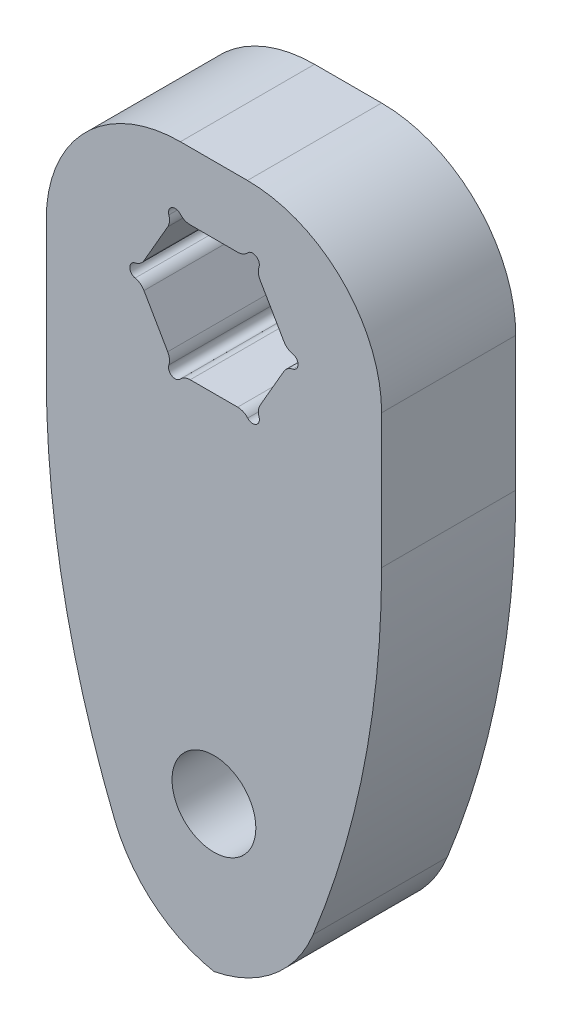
ISO-10303-21;
HEADER;
FILE_DESCRIPTION(('STEP AP214'),'2;1');
FILE_NAME('part.step','',(''),(''),'','','');
FILE_SCHEMA(('AUTOMOTIVE_DESIGN { 1 0 10303 214 1 1 1 1 }'));
ENDSEC;
DATA;
#1=APPLICATION_CONTEXT('core data for automotive mechanical design processes');
#2=APPLICATION_PROTOCOL_DEFINITION('international standard','automotive_design',2000,#1);
#3=PRODUCT_CONTEXT('',#1,'mechanical');
#4=PRODUCT('Part','Part','',(#3));
#5=PRODUCT_RELATED_PRODUCT_CATEGORY('part','',(#4));
#6=PRODUCT_DEFINITION_FORMATION('','',#4);
#7=PRODUCT_DEFINITION_CONTEXT('part definition',#1,'design');
#8=PRODUCT_DEFINITION('design','',#6,#7);
#9=PRODUCT_DEFINITION_SHAPE('','',#8);
#10=(LENGTH_UNIT() NAMED_UNIT(*) SI_UNIT(.MILLI.,.METRE.));
#11=(NAMED_UNIT(*) PLANE_ANGLE_UNIT() SI_UNIT($,.RADIAN.));
#12=(NAMED_UNIT(*) SI_UNIT($,.STERADIAN.) SOLID_ANGLE_UNIT());
#13=UNCERTAINTY_MEASURE_WITH_UNIT(LENGTH_MEASURE(1.E-05),#10,'distance_accuracy_value','');
#14=(GEOMETRIC_REPRESENTATION_CONTEXT(3) GLOBAL_UNCERTAINTY_ASSIGNED_CONTEXT((#13)) GLOBAL_UNIT_ASSIGNED_CONTEXT((#10,
#11,#12)) REPRESENTATION_CONTEXT('',''));
#15=CARTESIAN_POINT('',(0.,0.,0.));
#16=DIRECTION('',(0.,0.,1.));
#17=DIRECTION('',(1.,0.,0.));
#18=AXIS2_PLACEMENT_3D('',#15,#16,#17);
#19=CARTESIAN_POINT('',(0.,0.,12.7));
#20=DIRECTION('',(0.,0.,-1.));
#21=DIRECTION('',(-1.,0.,0.));
#22=AXIS2_PLACEMENT_3D('',#19,#20,#21);
#23=PLANE('',#22);
#24=CARTESIAN_POINT('',(-3.66617420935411,6.35000000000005,12.7));
#25=DIRECTION('',(0.,0.,1.));
#26=DIRECTION('',(1.,0.,0.));
#27=AXIS2_PLACEMENT_3D('',#24,#25,#26);
#28=CIRCLE('',#27,0.635);
#29=CARTESIAN_POINT('',(-3.19287315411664,6.77333333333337,12.7));
#30=VERTEX_POINT('',#29);
#31=CARTESIAN_POINT('',(-4.26944215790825,6.15177592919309,12.7));
#32=VERTEX_POINT('',#31);
#33=EDGE_CURVE('E314',#30,#32,#28,.T.);
#34=ORIENTED_EDGE('',*,*,#33,.F.);
#35=CARTESIAN_POINT('',(-2.2462710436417,7.62000000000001,12.7));
#36=DIRECTION('',(0.,0.,-1.));
#37=DIRECTION('',(-1.,0.,0.));
#38=AXIS2_PLACEMENT_3D('',#35,#36,#37);
#39=CIRCLE('',#38,1.27);
#40=CARTESIAN_POINT('',(-2.2462710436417,6.35,12.7));
#41=VERTEX_POINT('',#40);
#42=EDGE_CURVE('E404',#30,#41,#39,.F.);
#43=ORIENTED_EDGE('',*,*,#42,.T.);
#44=DIRECTION('',(-1.,0.,0.));
#45=VECTOR('',#44,1.);
#46=CARTESIAN_POINT('',(3.66617420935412,6.35000000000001,12.7));
#47=LINE('',#46,#45);
#48=CARTESIAN_POINT('',(2.24627104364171,6.35000000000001,12.7));
#49=VERTEX_POINT('',#48);
#50=EDGE_CURVE('E336',#49,#41,#47,.T.);
#51=ORIENTED_EDGE('',*,*,#50,.F.);
#52=CARTESIAN_POINT('',(2.24627104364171,7.62000000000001,12.7));
#53=DIRECTION('',(0.,0.,-1.));
#54=DIRECTION('',(-1.,0.,0.));
#55=AXIS2_PLACEMENT_3D('',#52,#53,#54);
#56=CIRCLE('',#55,1.27);
#57=CARTESIAN_POINT('',(3.19287315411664,6.77333333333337,12.7));
#58=VERTEX_POINT('',#57);
#59=EDGE_CURVE('E402',#49,#58,#56,.F.);
#60=ORIENTED_EDGE('',*,*,#59,.T.);
#61=CARTESIAN_POINT('',(3.66617420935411,6.35000000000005,12.7));
#62=DIRECTION('',(0.,0.,1.));
#63=DIRECTION('',(1.,0.,0.));
#64=AXIS2_PLACEMENT_3D('',#61,#62,#63);
#65=CIRCLE('',#64,0.635000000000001);
#66=CARTESIAN_POINT('',(4.26944215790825,6.15177592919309,12.7));
#67=VERTEX_POINT('',#66);
#68=EDGE_CURVE('E308',#67,#58,#65,.T.);
#69=ORIENTED_EDGE('',*,*,#68,.F.);
#70=CARTESIAN_POINT('',(5.47597805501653,5.75532778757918,12.7));
#71=DIRECTION('',(0.,0.,-1.));
#72=DIRECTION('',(-1.,0.,0.));
#73=AXIS2_PLACEMENT_3D('',#70,#71,#72);
#74=CIRCLE('',#73,1.27);
#75=CARTESIAN_POINT('',(4.37612579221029,5.12032778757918,12.7));
#76=VERTEX_POINT('',#75);
#77=EDGE_CURVE('E400',#67,#76,#74,.F.);
#78=ORIENTED_EDGE('',*,*,#77,.T.);
#79=DIRECTION('',(-0.5,0.866025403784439,0.));
#80=VECTOR('',#79,1.);
#81=CARTESIAN_POINT('',(7.33234841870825,0.,12.7));
#82=LINE('',#81,#80);
#83=CARTESIAN_POINT('',(6.62239683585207,1.22967221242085,12.7));
#84=VERTEX_POINT('',#83);
#85=EDGE_CURVE('E332',#84,#76,#82,.T.);
#86=ORIENTED_EDGE('',*,*,#85,.F.);
#87=CARTESIAN_POINT('',(7.72224909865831,1.86467221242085,12.7));
#88=DIRECTION('',(0.,0.,-1.));
#89=DIRECTION('',(-1.,0.,0.));
#90=AXIS2_PLACEMENT_3D('',#87,#88,#89);
#91=CIRCLE('',#90,1.27);
#92=CARTESIAN_POINT('',(7.46231531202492,0.621557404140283,12.7));
#93=VERTEX_POINT('',#92);
#94=EDGE_CURVE('E398',#84,#93,#91,.F.);
#95=ORIENTED_EDGE('',*,*,#94,.T.);
#96=CARTESIAN_POINT('',(7.33234841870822,0.,12.7));
#97=DIRECTION('',(0.,0.,1.));
#98=DIRECTION('',(1.,0.,0.));
#99=AXIS2_PLACEMENT_3D('',#96,#97,#98);
#100=CIRCLE('',#99,0.635000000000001);
#101=CARTESIAN_POINT('',(7.46231531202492,-0.621557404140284,12.7));
#102=VERTEX_POINT('',#101);
#103=EDGE_CURVE('E302',#102,#93,#100,.T.);
#104=ORIENTED_EDGE('',*,*,#103,.F.);
#105=CARTESIAN_POINT('',(7.7222490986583,-1.86467221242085,12.7));
#106=DIRECTION('',(0.,0.,-1.));
#107=DIRECTION('',(-1.,0.,0.));
#108=AXIS2_PLACEMENT_3D('',#105,#106,#107);
#109=CIRCLE('',#108,1.27);
#110=CARTESIAN_POINT('',(6.62239683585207,-1.22967221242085,12.7));
#111=VERTEX_POINT('',#110);
#112=EDGE_CURVE('E396',#102,#111,#109,.F.);
#113=ORIENTED_EDGE('',*,*,#112,.T.);
#114=DIRECTION('',(0.5,0.866025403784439,0.));
#115=VECTOR('',#114,1.);
#116=CARTESIAN_POINT('',(3.66617420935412,-6.35,12.7));
#117=LINE('',#116,#115);
#118=CARTESIAN_POINT('',(4.3761257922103,-5.12032778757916,12.7));
#119=VERTEX_POINT('',#118);
#120=EDGE_CURVE('E329',#119,#111,#117,.T.);
#121=ORIENTED_EDGE('',*,*,#120,.F.);
#122=CARTESIAN_POINT('',(5.47597805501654,-5.75532778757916,12.7));
#123=DIRECTION('',(0.,0.,-1.));
#124=DIRECTION('',(-1.,0.,0.));
#125=AXIS2_PLACEMENT_3D('',#122,#123,#124);
#126=CIRCLE('',#125,1.27);
#127=CARTESIAN_POINT('',(4.26944215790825,-6.15177592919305,12.7));
#128=VERTEX_POINT('',#127);
#129=EDGE_CURVE('E394',#119,#128,#126,.F.);
#130=ORIENTED_EDGE('',*,*,#129,.T.);
#131=CARTESIAN_POINT('',(3.66617420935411,-6.34999999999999,12.7));
#132=DIRECTION('',(0.,0.,1.));
#133=DIRECTION('',(1.,0.,0.));
#134=AXIS2_PLACEMENT_3D('',#131,#132,#133);
#135=CIRCLE('',#134,0.635000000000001);
#136=CARTESIAN_POINT('',(3.19287315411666,-6.77333333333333,12.7));
#137=VERTEX_POINT('',#136);
#138=EDGE_CURVE('E296',#137,#128,#135,.T.);
#139=ORIENTED_EDGE('',*,*,#138,.F.);
#140=CARTESIAN_POINT('',(2.24627104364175,-7.62,12.7));
#141=DIRECTION('',(0.,0.,-1.));
#142=DIRECTION('',(-1.,0.,0.));
#143=AXIS2_PLACEMENT_3D('',#140,#141,#142);
#144=CIRCLE('',#143,1.27);
#145=CARTESIAN_POINT('',(2.24627104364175,-6.35,12.7));
#146=VERTEX_POINT('',#145);
#147=EDGE_CURVE('E392',#137,#146,#144,.F.);
#148=ORIENTED_EDGE('',*,*,#147,.T.);
#149=DIRECTION('',(1.,0.,0.));
#150=VECTOR('',#149,1.);
#151=CARTESIAN_POINT('',(-3.66617420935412,-6.35,12.7));
#152=LINE('',#151,#150);
#153=CARTESIAN_POINT('',(-2.24627104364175,-6.35,12.7));
#154=VERTEX_POINT('',#153);
#155=EDGE_CURVE('E345',#154,#146,#152,.T.);
#156=ORIENTED_EDGE('',*,*,#155,.F.);
#157=CARTESIAN_POINT('',(-2.24627104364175,-7.62,12.7));
#158=DIRECTION('',(0.,0.,-1.));
#159=DIRECTION('',(-1.,0.,0.));
#160=AXIS2_PLACEMENT_3D('',#157,#158,#159);
#161=CIRCLE('',#160,1.27);
#162=CARTESIAN_POINT('',(-3.19287315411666,-6.77333333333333,12.7));
#163=VERTEX_POINT('',#162);
#164=EDGE_CURVE('E390',#154,#163,#161,.F.);
#165=ORIENTED_EDGE('',*,*,#164,.T.);
#166=CARTESIAN_POINT('',(-3.66617420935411,-6.34999999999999,12.7));
#167=DIRECTION('',(0.,0.,1.));
#168=DIRECTION('',(1.,0.,0.));
#169=AXIS2_PLACEMENT_3D('',#166,#167,#168);
#170=CIRCLE('',#169,0.635);
#171=CARTESIAN_POINT('',(-4.26944215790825,-6.15177592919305,12.7));
#172=VERTEX_POINT('',#171);
#173=EDGE_CURVE('E290',#172,#163,#170,.T.);
#174=ORIENTED_EDGE('',*,*,#173,.F.);
#175=CARTESIAN_POINT('',(-5.47597805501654,-5.75532778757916,12.7));
#176=DIRECTION('',(0.,0.,-1.));
#177=DIRECTION('',(-1.,0.,0.));
#178=AXIS2_PLACEMENT_3D('',#175,#176,#177);
#179=CIRCLE('',#178,1.27);
#180=CARTESIAN_POINT('',(-4.3761257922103,-5.12032778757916,12.7));
#181=VERTEX_POINT('',#180);
#182=EDGE_CURVE('E388',#172,#181,#179,.F.);
#183=ORIENTED_EDGE('',*,*,#182,.T.);
#184=DIRECTION('',(0.5,-0.866025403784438,0.));
#185=VECTOR('',#184,1.);
#186=CARTESIAN_POINT('',(-7.33234841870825,0.,12.7));
#187=LINE('',#186,#185);
#188=CARTESIAN_POINT('',(-6.62239683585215,-1.22967221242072,12.7));
#189=VERTEX_POINT('',#188);
#190=EDGE_CURVE('E342',#189,#181,#187,.T.);
#191=ORIENTED_EDGE('',*,*,#190,.F.);
#192=CARTESIAN_POINT('',(-7.72224909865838,-1.86467221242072,12.7));
#193=DIRECTION('',(0.,0.,-1.));
#194=DIRECTION('',(-1.,0.,0.));
#195=AXIS2_PLACEMENT_3D('',#192,#193,#194);
#196=CIRCLE('',#195,1.27);
#197=CARTESIAN_POINT('',(-7.46231531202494,-0.621557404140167,12.7));
#198=VERTEX_POINT('',#197);
#199=EDGE_CURVE('E386',#189,#198,#196,.F.);
#200=ORIENTED_EDGE('',*,*,#199,.T.);
#201=CARTESIAN_POINT('',(-7.33234841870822,1.11022302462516E-13,12.7));
#202=DIRECTION('',(0.,0.,1.));
#203=DIRECTION('',(1.,0.,0.));
#204=AXIS2_PLACEMENT_3D('',#201,#202,#203);
#205=CIRCLE('',#204,0.635000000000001);
#206=CARTESIAN_POINT('',(-7.46231531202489,0.621557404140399,12.7));
#207=VERTEX_POINT('',#206);
#208=EDGE_CURVE('E286',#207,#198,#205,.T.);
#209=ORIENTED_EDGE('',*,*,#208,.F.);
#210=CARTESIAN_POINT('',(-7.72224909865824,1.86467221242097,12.7));
#211=DIRECTION('',(0.,0.,-1.));
#212=DIRECTION('',(-1.,0.,0.));
#213=AXIS2_PLACEMENT_3D('',#210,#211,#212);
#214=CIRCLE('',#213,1.27);
#215=CARTESIAN_POINT('',(-6.622396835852,1.22967221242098,12.7));
#216=VERTEX_POINT('',#215);
#217=EDGE_CURVE('E384',#207,#216,#214,.F.);
#218=ORIENTED_EDGE('',*,*,#217,.T.);
#219=DIRECTION('',(-0.5,-0.866025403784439,0.));
#220=VECTOR('',#219,1.);
#221=CARTESIAN_POINT('',(-3.66617420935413,6.35,12.7));
#222=LINE('',#221,#220);
#223=CARTESIAN_POINT('',(-4.37612579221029,5.12032778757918,12.7));
#224=VERTEX_POINT('',#223);
#225=EDGE_CURVE('E339',#224,#216,#222,.T.);
#226=ORIENTED_EDGE('',*,*,#225,.F.);
#227=CARTESIAN_POINT('',(-5.47597805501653,5.75532778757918,12.7));
#228=DIRECTION('',(0.,0.,-1.));
#229=DIRECTION('',(-1.,0.,0.));
#230=AXIS2_PLACEMENT_3D('',#227,#228,#229);
#231=CIRCLE('',#230,1.27);
#232=EDGE_CURVE('E382',#224,#32,#231,.F.);
#233=ORIENTED_EDGE('',*,*,#232,.T.);
#234=EDGE_LOOP('',(#34,#43,#51,#60,#69,#78,#86,#95,#104,#113,#121,#130,#139,#148,#156,#165,#174,
#183,#191,#200,#209,#218,#226,#233));
#235=FACE_BOUND('',#234,.T.);
#236=CARTESIAN_POINT('',(0.,-40.000682,12.7));
#237=DIRECTION('',(0.,0.,1.));
#238=DIRECTION('',(1.,0.,0.));
#239=AXIS2_PLACEMENT_3D('',#236,#237,#238);
#240=CIRCLE('',#239,3.96875);
#241=CARTESIAN_POINT('',(3.96875,-40.000682,12.7));
#242=VERTEX_POINT('',#241);
#243=EDGE_CURVE('E320',#242,#242,#240,.T.);
#244=ORIENTED_EDGE('',*,*,#243,.F.);
#245=EDGE_LOOP('',(#244));
#246=FACE_BOUND('',#245,.T.);
#247=CARTESIAN_POINT('',(73.025,-12.7,12.7));
#248=DIRECTION('',(0.,0.,1.));
#249=DIRECTION('',(1.,0.,0.));
#250=AXIS2_PLACEMENT_3D('',#247,#248,#249);
#251=CIRCLE('',#250,88.9);
#252=CARTESIAN_POINT('',(-15.875,-12.7,12.7));
#253=VERTEX_POINT('',#252);
#254=CARTESIAN_POINT('',(-9.38750568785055,-46.0375,12.7));
#255=VERTEX_POINT('',#254);
#256=EDGE_CURVE('E272',#253,#255,#251,.T.);
#257=ORIENTED_EDGE('',*,*,#256,.T.);
#258=CARTESIAN_POINT('',(2.38570941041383,-41.275,12.7));
#259=DIRECTION('',(0.,0.,-1.));
#260=DIRECTION('',(-1.,0.,0.));
#261=AXIS2_PLACEMENT_3D('',#258,#259,#260);
#262=CIRCLE('',#261,12.7);
#263=CARTESIAN_POINT('',(0.,-53.7489083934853,12.7));
#264=VERTEX_POINT('',#263);
#265=EDGE_CURVE('E492',#255,#264,#262,.F.);
#266=ORIENTED_EDGE('',*,*,#265,.T.);
#267=CARTESIAN_POINT('',(-2.38570941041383,-41.275,12.7));
#268=DIRECTION('',(0.,0.,-1.));
#269=DIRECTION('',(-1.,0.,0.));
#270=AXIS2_PLACEMENT_3D('',#267,#268,#269);
#271=CIRCLE('',#270,12.7);
#272=CARTESIAN_POINT('',(9.38750568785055,-46.0375,12.7));
#273=VERTEX_POINT('',#272);
#274=EDGE_CURVE('E490',#264,#273,#271,.F.);
#275=ORIENTED_EDGE('',*,*,#274,.T.);
#276=CARTESIAN_POINT('',(-73.025,-12.7,12.7));
#277=DIRECTION('',(0.,0.,1.));
#278=DIRECTION('',(1.,0.,0.));
#279=AXIS2_PLACEMENT_3D('',#276,#277,#278);
#280=CIRCLE('',#279,88.9);
#281=CARTESIAN_POINT('',(15.875,-12.7,12.7));
#282=VERTEX_POINT('',#281);
#283=EDGE_CURVE('E273',#282,#273,#280,.F.);
#284=ORIENTED_EDGE('',*,*,#283,.F.);
#285=DIRECTION('',(0.,1.,0.));
#286=VECTOR('',#285,1.);
#287=CARTESIAN_POINT('',(15.875,12.7,12.7));
#288=LINE('',#287,#286);
#289=CARTESIAN_POINT('',(15.875,0.,12.7));
#290=VERTEX_POINT('',#289);
#291=EDGE_CURVE('E261',#282,#290,#288,.T.);
#292=ORIENTED_EDGE('',*,*,#291,.T.);
#293=CARTESIAN_POINT('',(3.175,0.,12.7));
#294=DIRECTION('',(0.,0.,-1.));
#295=DIRECTION('',(-1.,0.,0.));
#296=AXIS2_PLACEMENT_3D('',#293,#294,#295);
#297=CIRCLE('',#296,12.7);
#298=CARTESIAN_POINT('',(3.175,12.7,12.7));
#299=VERTEX_POINT('',#298);
#300=EDGE_CURVE('E488',#290,#299,#297,.F.);
#301=ORIENTED_EDGE('',*,*,#300,.T.);
#302=DIRECTION('',(-1.,0.,0.));
#303=VECTOR('',#302,1.);
#304=CARTESIAN_POINT('',(-15.875,12.7,12.7));
#305=LINE('',#304,#303);
#306=CARTESIAN_POINT('',(-3.175,12.7,12.7));
#307=VERTEX_POINT('',#306);
#308=EDGE_CURVE('E367',#299,#307,#305,.T.);
#309=ORIENTED_EDGE('',*,*,#308,.T.);
#310=CARTESIAN_POINT('',(-3.175,0.,12.7));
#311=DIRECTION('',(0.,0.,-1.));
#312=DIRECTION('',(-1.,0.,0.));
#313=AXIS2_PLACEMENT_3D('',#310,#311,#312);
#314=CIRCLE('',#313,12.7);
#315=CARTESIAN_POINT('',(-15.875,0.,12.7));
#316=VERTEX_POINT('',#315);
#317=EDGE_CURVE('E486',#307,#316,#314,.F.);
#318=ORIENTED_EDGE('',*,*,#317,.T.);
#319=DIRECTION('',(0.,-1.,0.));
#320=VECTOR('',#319,1.);
#321=CARTESIAN_POINT('',(-15.875,-53.975,12.7));
#322=LINE('',#321,#320);
#323=EDGE_CURVE('E370',#316,#253,#322,.T.);
#324=ORIENTED_EDGE('',*,*,#323,.T.);
#325=EDGE_LOOP('',(#257,#266,#275,#284,#292,#301,#309,#318,#324));
#326=FACE_BOUND('',#325,.T.);
#327=ADVANCED_FACE('F37',(#235,#246,#326),#23,.F.);
#328=CARTESIAN_POINT('',(0.,0.,0.));
#329=DIRECTION('',(0.,0.,-1.));
#330=DIRECTION('',(-1.,0.,0.));
#331=AXIS2_PLACEMENT_3D('',#328,#329,#330);
#332=PLANE('',#331);
#333=CARTESIAN_POINT('',(0.,-40.000682,0.));
#334=DIRECTION('',(0.,0.,1.));
#335=DIRECTION('',(1.,0.,0.));
#336=AXIS2_PLACEMENT_3D('',#333,#334,#335);
#337=CIRCLE('',#336,3.96875);
#338=CARTESIAN_POINT('',(3.96875,-40.000682,0.));
#339=VERTEX_POINT('',#338);
#340=EDGE_CURVE('E325',#339,#339,#337,.T.);
#341=ORIENTED_EDGE('',*,*,#340,.T.);
#342=EDGE_LOOP('',(#341));
#343=FACE_BOUND('',#342,.T.);
#344=DIRECTION('',(-1.,0.,0.));
#345=VECTOR('',#344,1.);
#346=CARTESIAN_POINT('',(3.66617420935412,6.35000000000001,0.));
#347=LINE('',#346,#345);
#348=CARTESIAN_POINT('',(2.24627104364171,6.35000000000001,0.));
#349=VERTEX_POINT('',#348);
#350=CARTESIAN_POINT('',(-2.2462710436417,6.35,0.));
#351=VERTEX_POINT('',#350);
#352=EDGE_CURVE('E354',#349,#351,#347,.T.);
#353=ORIENTED_EDGE('',*,*,#352,.T.);
#354=CARTESIAN_POINT('',(-2.2462710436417,7.62000000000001,0.));
#355=DIRECTION('',(0.,0.,-1.));
#356=DIRECTION('',(-1.,0.,0.));
#357=AXIS2_PLACEMENT_3D('',#354,#355,#356);
#358=CIRCLE('',#357,1.27);
#359=CARTESIAN_POINT('',(-3.19287315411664,6.77333333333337,0.));
#360=VERTEX_POINT('',#359);
#361=EDGE_CURVE('E432',#351,#360,#358,.T.);
#362=ORIENTED_EDGE('',*,*,#361,.T.);
#363=CARTESIAN_POINT('',(-3.66617420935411,6.35000000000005,0.));
#364=DIRECTION('',(0.,0.,1.));
#365=DIRECTION('',(1.,0.,0.));
#366=AXIS2_PLACEMENT_3D('',#363,#364,#365);
#367=CIRCLE('',#366,0.635);
#368=CARTESIAN_POINT('',(-4.26944215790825,6.15177592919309,0.));
#369=VERTEX_POINT('',#368);
#370=EDGE_CURVE('E317',#360,#369,#367,.T.);
#371=ORIENTED_EDGE('',*,*,#370,.T.);
#372=CARTESIAN_POINT('',(-5.47597805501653,5.75532778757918,0.));
#373=DIRECTION('',(0.,0.,-1.));
#374=DIRECTION('',(-1.,0.,0.));
#375=AXIS2_PLACEMENT_3D('',#372,#373,#374);
#376=CIRCLE('',#375,1.27);
#377=CARTESIAN_POINT('',(-4.37612579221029,5.12032778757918,0.));
#378=VERTEX_POINT('',#377);
#379=EDGE_CURVE('E410',#369,#378,#376,.T.);
#380=ORIENTED_EDGE('',*,*,#379,.T.);
#381=DIRECTION('',(-0.5,-0.866025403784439,0.));
#382=VECTOR('',#381,1.);
#383=CARTESIAN_POINT('',(-3.66617420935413,6.35,0.));
#384=LINE('',#383,#382);
#385=CARTESIAN_POINT('',(-6.622396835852,1.22967221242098,0.));
#386=VERTEX_POINT('',#385);
#387=EDGE_CURVE('E357',#378,#386,#384,.T.);
#388=ORIENTED_EDGE('',*,*,#387,.T.);
#389=CARTESIAN_POINT('',(-7.72224909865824,1.86467221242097,0.));
#390=DIRECTION('',(0.,0.,-1.));
#391=DIRECTION('',(-1.,0.,0.));
#392=AXIS2_PLACEMENT_3D('',#389,#390,#391);
#393=CIRCLE('',#392,1.27);
#394=CARTESIAN_POINT('',(-7.46231531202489,0.621557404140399,0.));
#395=VERTEX_POINT('',#394);
#396=EDGE_CURVE('E412',#386,#395,#393,.T.);
#397=ORIENTED_EDGE('',*,*,#396,.T.);
#398=CARTESIAN_POINT('',(-7.33234841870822,1.11022302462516E-13,0.));
#399=DIRECTION('',(0.,0.,1.));
#400=DIRECTION('',(1.,0.,0.));
#401=AXIS2_PLACEMENT_3D('',#398,#399,#400);
#402=CIRCLE('',#401,0.635000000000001);
#403=CARTESIAN_POINT('',(-7.46231531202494,-0.621557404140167,0.));
#404=VERTEX_POINT('',#403);
#405=EDGE_CURVE('E287',#395,#404,#402,.T.);
#406=ORIENTED_EDGE('',*,*,#405,.T.);
#407=CARTESIAN_POINT('',(-7.72224909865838,-1.86467221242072,0.));
#408=DIRECTION('',(0.,0.,-1.));
#409=DIRECTION('',(-1.,0.,0.));
#410=AXIS2_PLACEMENT_3D('',#407,#408,#409);
#411=CIRCLE('',#410,1.27);
#412=CARTESIAN_POINT('',(-6.62239683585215,-1.22967221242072,0.));
#413=VERTEX_POINT('',#412);
#414=EDGE_CURVE('E414',#404,#413,#411,.T.);
#415=ORIENTED_EDGE('',*,*,#414,.T.);
#416=DIRECTION('',(0.5,-0.866025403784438,0.));
#417=VECTOR('',#416,1.);
#418=CARTESIAN_POINT('',(-7.33234841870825,0.,0.));
#419=LINE('',#418,#417);
#420=CARTESIAN_POINT('',(-4.3761257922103,-5.12032778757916,0.));
#421=VERTEX_POINT('',#420);
#422=EDGE_CURVE('E360',#413,#421,#419,.T.);
#423=ORIENTED_EDGE('',*,*,#422,.T.);
#424=CARTESIAN_POINT('',(-5.47597805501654,-5.75532778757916,0.));
#425=DIRECTION('',(0.,0.,-1.));
#426=DIRECTION('',(-1.,0.,0.));
#427=AXIS2_PLACEMENT_3D('',#424,#425,#426);
#428=CIRCLE('',#427,1.27);
#429=CARTESIAN_POINT('',(-4.26944215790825,-6.15177592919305,0.));
#430=VERTEX_POINT('',#429);
#431=EDGE_CURVE('E416',#421,#430,#428,.T.);
#432=ORIENTED_EDGE('',*,*,#431,.T.);
#433=CARTESIAN_POINT('',(-3.66617420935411,-6.34999999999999,0.));
#434=DIRECTION('',(0.,0.,1.));
#435=DIRECTION('',(1.,0.,0.));
#436=AXIS2_PLACEMENT_3D('',#433,#434,#435);
#437=CIRCLE('',#436,0.635);
#438=CARTESIAN_POINT('',(-3.19287315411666,-6.77333333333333,0.));
#439=VERTEX_POINT('',#438);
#440=EDGE_CURVE('E293',#430,#439,#437,.T.);
#441=ORIENTED_EDGE('',*,*,#440,.T.);
#442=CARTESIAN_POINT('',(-2.24627104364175,-7.62,0.));
#443=DIRECTION('',(0.,0.,-1.));
#444=DIRECTION('',(-1.,0.,0.));
#445=AXIS2_PLACEMENT_3D('',#442,#443,#444);
#446=CIRCLE('',#445,1.27);
#447=CARTESIAN_POINT('',(-2.24627104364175,-6.35,0.));
#448=VERTEX_POINT('',#447);
#449=EDGE_CURVE('E418',#439,#448,#446,.T.);
#450=ORIENTED_EDGE('',*,*,#449,.T.);
#451=DIRECTION('',(1.,0.,0.));
#452=VECTOR('',#451,1.);
#453=CARTESIAN_POINT('',(-3.66617420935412,-6.35,0.));
#454=LINE('',#453,#452);
#455=CARTESIAN_POINT('',(2.24627104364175,-6.35,0.));
#456=VERTEX_POINT('',#455);
#457=EDGE_CURVE('E333',#448,#456,#454,.T.);
#458=ORIENTED_EDGE('',*,*,#457,.T.);
#459=CARTESIAN_POINT('',(2.24627104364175,-7.62,0.));
#460=DIRECTION('',(0.,0.,-1.));
#461=DIRECTION('',(-1.,0.,0.));
#462=AXIS2_PLACEMENT_3D('',#459,#460,#461);
#463=CIRCLE('',#462,1.27);
#464=CARTESIAN_POINT('',(3.19287315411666,-6.77333333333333,0.));
#465=VERTEX_POINT('',#464);
#466=EDGE_CURVE('E420',#456,#465,#463,.T.);
#467=ORIENTED_EDGE('',*,*,#466,.T.);
#468=CARTESIAN_POINT('',(3.66617420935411,-6.34999999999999,0.));
#469=DIRECTION('',(0.,0.,1.));
#470=DIRECTION('',(1.,0.,0.));
#471=AXIS2_PLACEMENT_3D('',#468,#469,#470);
#472=CIRCLE('',#471,0.635000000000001);
#473=CARTESIAN_POINT('',(4.26944215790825,-6.15177592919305,0.));
#474=VERTEX_POINT('',#473);
#475=EDGE_CURVE('E299',#465,#474,#472,.T.);
#476=ORIENTED_EDGE('',*,*,#475,.T.);
#477=CARTESIAN_POINT('',(5.47597805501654,-5.75532778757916,0.));
#478=DIRECTION('',(0.,0.,-1.));
#479=DIRECTION('',(-1.,0.,0.));
#480=AXIS2_PLACEMENT_3D('',#477,#478,#479);
#481=CIRCLE('',#480,1.27);
#482=CARTESIAN_POINT('',(4.3761257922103,-5.12032778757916,0.));
#483=VERTEX_POINT('',#482);
#484=EDGE_CURVE('E422',#474,#483,#481,.T.);
#485=ORIENTED_EDGE('',*,*,#484,.T.);
#486=DIRECTION('',(0.5,0.866025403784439,0.));
#487=VECTOR('',#486,1.);
#488=CARTESIAN_POINT('',(3.66617420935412,-6.35,0.));
#489=LINE('',#488,#487);
#490=CARTESIAN_POINT('',(6.62239683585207,-1.22967221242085,0.));
#491=VERTEX_POINT('',#490);
#492=EDGE_CURVE('E328',#483,#491,#489,.T.);
#493=ORIENTED_EDGE('',*,*,#492,.T.);
#494=CARTESIAN_POINT('',(7.7222490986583,-1.86467221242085,0.));
#495=DIRECTION('',(0.,0.,-1.));
#496=DIRECTION('',(-1.,0.,0.));
#497=AXIS2_PLACEMENT_3D('',#494,#495,#496);
#498=CIRCLE('',#497,1.27);
#499=CARTESIAN_POINT('',(7.46231531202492,-0.621557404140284,0.));
#500=VERTEX_POINT('',#499);
#501=EDGE_CURVE('E424',#491,#500,#498,.T.);
#502=ORIENTED_EDGE('',*,*,#501,.T.);
#503=CARTESIAN_POINT('',(7.33234841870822,0.,0.));
#504=DIRECTION('',(0.,0.,1.));
#505=DIRECTION('',(1.,0.,0.));
#506=AXIS2_PLACEMENT_3D('',#503,#504,#505);
#507=CIRCLE('',#506,0.635000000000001);
#508=CARTESIAN_POINT('',(7.46231531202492,0.621557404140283,0.));
#509=VERTEX_POINT('',#508);
#510=EDGE_CURVE('E305',#500,#509,#507,.T.);
#511=ORIENTED_EDGE('',*,*,#510,.T.);
#512=CARTESIAN_POINT('',(7.72224909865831,1.86467221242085,0.));
#513=DIRECTION('',(0.,0.,-1.));
#514=DIRECTION('',(-1.,0.,0.));
#515=AXIS2_PLACEMENT_3D('',#512,#513,#514);
#516=CIRCLE('',#515,1.27);
#517=CARTESIAN_POINT('',(6.62239683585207,1.22967221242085,0.));
#518=VERTEX_POINT('',#517);
#519=EDGE_CURVE('E426',#509,#518,#516,.T.);
#520=ORIENTED_EDGE('',*,*,#519,.T.);
#521=DIRECTION('',(-0.5,0.866025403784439,0.));
#522=VECTOR('',#521,1.);
#523=CARTESIAN_POINT('',(7.33234841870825,0.,0.));
#524=LINE('',#523,#522);
#525=CARTESIAN_POINT('',(4.37612579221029,5.12032778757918,0.));
#526=VERTEX_POINT('',#525);
#527=EDGE_CURVE('E351',#518,#526,#524,.T.);
#528=ORIENTED_EDGE('',*,*,#527,.T.);
#529=CARTESIAN_POINT('',(5.47597805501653,5.75532778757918,0.));
#530=DIRECTION('',(0.,0.,-1.));
#531=DIRECTION('',(-1.,0.,0.));
#532=AXIS2_PLACEMENT_3D('',#529,#530,#531);
#533=CIRCLE('',#532,1.27);
#534=CARTESIAN_POINT('',(4.26944215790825,6.15177592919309,0.));
#535=VERTEX_POINT('',#534);
#536=EDGE_CURVE('E428',#526,#535,#533,.T.);
#537=ORIENTED_EDGE('',*,*,#536,.T.);
#538=CARTESIAN_POINT('',(3.66617420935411,6.35000000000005,0.));
#539=DIRECTION('',(0.,0.,1.));
#540=DIRECTION('',(1.,0.,0.));
#541=AXIS2_PLACEMENT_3D('',#538,#539,#540);
#542=CIRCLE('',#541,0.635000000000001);
#543=CARTESIAN_POINT('',(3.19287315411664,6.77333333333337,0.));
#544=VERTEX_POINT('',#543);
#545=EDGE_CURVE('E311',#535,#544,#542,.T.);
#546=ORIENTED_EDGE('',*,*,#545,.T.);
#547=CARTESIAN_POINT('',(2.24627104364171,7.62000000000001,0.));
#548=DIRECTION('',(0.,0.,-1.));
#549=DIRECTION('',(-1.,0.,0.));
#550=AXIS2_PLACEMENT_3D('',#547,#548,#549);
#551=CIRCLE('',#550,1.27);
#552=EDGE_CURVE('E430',#544,#349,#551,.T.);
#553=ORIENTED_EDGE('',*,*,#552,.T.);
#554=EDGE_LOOP('',(#353,#362,#371,#380,#388,#397,#406,#415,#423,#432,#441,#450,#458,#467,#476,
#485,#493,#502,#511,#520,#528,#537,#546,#553));
#555=FACE_BOUND('',#554,.T.);
#556=CARTESIAN_POINT('',(-2.38570941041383,-41.275,0.));
#557=DIRECTION('',(0.,0.,-1.));
#558=DIRECTION('',(-1.,0.,0.));
#559=AXIS2_PLACEMENT_3D('',#556,#557,#558);
#560=CIRCLE('',#559,12.7);
#561=CARTESIAN_POINT('',(9.38750568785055,-46.0375,0.));
#562=VERTEX_POINT('',#561);
#563=CARTESIAN_POINT('',(0.,-53.7489083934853,0.));
#564=VERTEX_POINT('',#563);
#565=EDGE_CURVE('E53',#562,#564,#560,.T.);
#566=ORIENTED_EDGE('',*,*,#565,.T.);
#567=CARTESIAN_POINT('',(2.38570941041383,-41.275,0.));
#568=DIRECTION('',(0.,0.,-1.));
#569=DIRECTION('',(-1.,0.,0.));
#570=AXIS2_PLACEMENT_3D('',#567,#568,#569);
#571=CIRCLE('',#570,12.7);
#572=CARTESIAN_POINT('',(-9.38750568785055,-46.0375,0.));
#573=VERTEX_POINT('',#572);
#574=EDGE_CURVE('E277',#564,#573,#571,.T.);
#575=ORIENTED_EDGE('',*,*,#574,.T.);
#576=CARTESIAN_POINT('',(73.025,-12.7,0.));
#577=DIRECTION('',(0.,0.,1.));
#578=DIRECTION('',(1.,0.,0.));
#579=AXIS2_PLACEMENT_3D('',#576,#577,#578);
#580=CIRCLE('',#579,88.9);
#581=CARTESIAN_POINT('',(-15.875,-12.7,0.));
#582=VERTEX_POINT('',#581);
#583=EDGE_CURVE('E269',#582,#573,#580,.T.);
#584=ORIENTED_EDGE('',*,*,#583,.F.);
#585=DIRECTION('',(0.,-1.,0.));
#586=VECTOR('',#585,1.);
#587=CARTESIAN_POINT('',(-15.875,-53.975,0.));
#588=LINE('',#587,#586);
#589=CARTESIAN_POINT('',(-15.875,0.,0.));
#590=VERTEX_POINT('',#589);
#591=EDGE_CURVE('E254',#590,#582,#588,.T.);
#592=ORIENTED_EDGE('',*,*,#591,.F.);
#593=CARTESIAN_POINT('',(-3.175,0.,0.));
#594=DIRECTION('',(0.,0.,-1.));
#595=DIRECTION('',(-1.,0.,0.));
#596=AXIS2_PLACEMENT_3D('',#593,#594,#595);
#597=CIRCLE('',#596,12.7);
#598=CARTESIAN_POINT('',(-3.175,12.7,0.));
#599=VERTEX_POINT('',#598);
#600=EDGE_CURVE('E494',#590,#599,#597,.T.);
#601=ORIENTED_EDGE('',*,*,#600,.T.);
#602=DIRECTION('',(-1.,0.,0.));
#603=VECTOR('',#602,1.);
#604=CARTESIAN_POINT('',(-15.875,12.7,0.));
#605=LINE('',#604,#603);
#606=CARTESIAN_POINT('',(3.175,12.7,0.));
#607=VERTEX_POINT('',#606);
#608=EDGE_CURVE('E262',#607,#599,#605,.T.);
#609=ORIENTED_EDGE('',*,*,#608,.F.);
#610=CARTESIAN_POINT('',(3.175,0.,0.));
#611=DIRECTION('',(0.,0.,-1.));
#612=DIRECTION('',(-1.,0.,0.));
#613=AXIS2_PLACEMENT_3D('',#610,#611,#612);
#614=CIRCLE('',#613,12.7);
#615=CARTESIAN_POINT('',(15.875,0.,0.));
#616=VERTEX_POINT('',#615);
#617=EDGE_CURVE('E496',#607,#616,#614,.T.);
#618=ORIENTED_EDGE('',*,*,#617,.T.);
#619=DIRECTION('',(0.,1.,0.));
#620=VECTOR('',#619,1.);
#621=CARTESIAN_POINT('',(15.875,12.7,0.));
#622=LINE('',#621,#620);
#623=CARTESIAN_POINT('',(15.875,-12.7,0.));
#624=VERTEX_POINT('',#623);
#625=EDGE_CURVE('E348',#624,#616,#622,.T.);
#626=ORIENTED_EDGE('',*,*,#625,.F.);
#627=CARTESIAN_POINT('',(-73.025,-12.7,0.));
#628=DIRECTION('',(0.,0.,1.));
#629=DIRECTION('',(1.,0.,0.));
#630=AXIS2_PLACEMENT_3D('',#627,#628,#629);
#631=CIRCLE('',#630,88.9);
#632=EDGE_CURVE('E281',#624,#562,#631,.F.);
#633=ORIENTED_EDGE('',*,*,#632,.T.);
#634=EDGE_LOOP('',(#566,#575,#584,#592,#601,#609,#618,#626,#633));
#635=FACE_BOUND('',#634,.T.);
#636=ADVANCED_FACE('F275',(#343,#555,#635),#332,.T.);
#637=CARTESIAN_POINT('',(15.875,12.7,12.7));
#638=DIRECTION('',(-1.,0.,0.));
#639=DIRECTION('',(0.,-1.,0.));
#640=AXIS2_PLACEMENT_3D('',#637,#638,#639);
#641=PLANE('',#640);
#642=ORIENTED_EDGE('',*,*,#625,.T.);
#643=DIRECTION('',(0.,0.,-1.));
#644=VECTOR('',#643,1.);
#645=CARTESIAN_POINT('',(15.875,0.,12.7));
#646=LINE('',#645,#644);
#647=EDGE_CURVE('E46',#616,#290,#646,.F.);
#648=ORIENTED_EDGE('',*,*,#647,.T.);
#649=ORIENTED_EDGE('',*,*,#291,.F.);
#650=DIRECTION('',(0.,0.,1.));
#651=VECTOR('',#650,1.);
#652=CARTESIAN_POINT('',(15.875,-12.7,0.));
#653=LINE('',#652,#651);
#654=EDGE_CURVE('E283',#624,#282,#653,.T.);
#655=ORIENTED_EDGE('',*,*,#654,.F.);
#656=EDGE_LOOP('',(#642,#648,#649,#655));
#657=FACE_BOUND('',#656,.T.);
#658=ADVANCED_FACE('F509',(#657),#641,.F.);
#659=CARTESIAN_POINT('',(-15.875,12.7,12.7));
#660=DIRECTION('',(0.,-1.,0.));
#661=DIRECTION('',(1.,0.,0.));
#662=AXIS2_PLACEMENT_3D('',#659,#660,#661);
#663=PLANE('',#662);
#664=ORIENTED_EDGE('',*,*,#308,.F.);
#665=DIRECTION('',(0.,0.,-1.));
#666=VECTOR('',#665,1.);
#667=CARTESIAN_POINT('',(3.175,12.7,12.7));
#668=LINE('',#667,#666);
#669=EDGE_CURVE('E503',#299,#607,#668,.T.);
#670=ORIENTED_EDGE('',*,*,#669,.T.);
#671=ORIENTED_EDGE('',*,*,#608,.T.);
#672=DIRECTION('',(0.,0.,-1.));
#673=VECTOR('',#672,1.);
#674=CARTESIAN_POINT('',(-3.175,12.7,12.7));
#675=LINE('',#674,#673);
#676=EDGE_CURVE('E501',#599,#307,#675,.F.);
#677=ORIENTED_EDGE('',*,*,#676,.T.);
#678=EDGE_LOOP('',(#664,#670,#671,#677));
#679=FACE_BOUND('',#678,.T.);
#680=ADVANCED_FACE('F521',(#679),#663,.F.);
#681=CARTESIAN_POINT('',(-15.875,-53.975,12.7));
#682=DIRECTION('',(1.,0.,0.));
#683=DIRECTION('',(0.,1.,0.));
#684=AXIS2_PLACEMENT_3D('',#681,#682,#683);
#685=PLANE('',#684);
#686=ORIENTED_EDGE('',*,*,#323,.F.);
#687=DIRECTION('',(0.,0.,-1.));
#688=VECTOR('',#687,1.);
#689=CARTESIAN_POINT('',(-15.875,0.,12.7));
#690=LINE('',#689,#688);
#691=EDGE_CURVE('E11',#316,#590,#690,.T.);
#692=ORIENTED_EDGE('',*,*,#691,.T.);
#693=ORIENTED_EDGE('',*,*,#591,.T.);
#694=DIRECTION('',(0.,0.,1.));
#695=VECTOR('',#694,1.);
#696=CARTESIAN_POINT('',(-15.875,-12.7,0.));
#697=LINE('',#696,#695);
#698=EDGE_CURVE('E258',#582,#253,#697,.T.);
#699=ORIENTED_EDGE('',*,*,#698,.T.);
#700=EDGE_LOOP('',(#686,#692,#693,#699));
#701=FACE_BOUND('',#700,.T.);
#702=ADVANCED_FACE('F257',(#701),#685,.F.);
#703=CARTESIAN_POINT('',(3.66617420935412,-6.35,12.7));
#704=DIRECTION('',(-0.866025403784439,0.5,0.));
#705=DIRECTION('',(-0.5,-0.866025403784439,0.));
#706=AXIS2_PLACEMENT_3D('',#703,#704,#705);
#707=PLANE('',#706);
#708=ORIENTED_EDGE('',*,*,#120,.T.);
#709=DIRECTION('',(0.,0.,-1.));
#710=VECTOR('',#709,1.);
#711=CARTESIAN_POINT('',(6.62239683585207,-1.22967221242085,0.));
#712=LINE('',#711,#710);
#713=EDGE_CURVE('E452',#111,#491,#712,.T.);
#714=ORIENTED_EDGE('',*,*,#713,.T.);
#715=ORIENTED_EDGE('',*,*,#492,.F.);
#716=DIRECTION('',(0.,0.,-1.));
#717=VECTOR('',#716,1.);
#718=CARTESIAN_POINT('',(4.3761257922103,-5.12032778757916,12.7));
#719=LINE('',#718,#717);
#720=EDGE_CURVE('E450',#483,#119,#719,.F.);
#721=ORIENTED_EDGE('',*,*,#720,.T.);
#722=EDGE_LOOP('',(#708,#714,#715,#721));
#723=FACE_BOUND('',#722,.T.);
#724=ADVANCED_FACE('F550',(#723),#707,.T.);
#725=CARTESIAN_POINT('',(7.33234841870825,0.,12.7));
#726=DIRECTION('',(-0.866025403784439,-0.5,0.));
#727=DIRECTION('',(0.5,-0.866025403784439,0.));
#728=AXIS2_PLACEMENT_3D('',#725,#726,#727);
#729=PLANE('',#728);
#730=ORIENTED_EDGE('',*,*,#85,.T.);
#731=DIRECTION('',(0.,0.,-1.));
#732=VECTOR('',#731,1.);
#733=CARTESIAN_POINT('',(4.37612579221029,5.12032778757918,0.));
#734=LINE('',#733,#732);
#735=EDGE_CURVE('E442',#76,#526,#734,.T.);
#736=ORIENTED_EDGE('',*,*,#735,.T.);
#737=ORIENTED_EDGE('',*,*,#527,.F.);
#738=DIRECTION('',(0.,0.,-1.));
#739=VECTOR('',#738,1.);
#740=CARTESIAN_POINT('',(6.62239683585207,1.22967221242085,12.7));
#741=LINE('',#740,#739);
#742=EDGE_CURVE('E440',#518,#84,#741,.F.);
#743=ORIENTED_EDGE('',*,*,#742,.T.);
#744=EDGE_LOOP('',(#730,#736,#737,#743));
#745=FACE_BOUND('',#744,.T.);
#746=ADVANCED_FACE('F638',(#745),#729,.T.);
#747=CARTESIAN_POINT('',(3.66617420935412,6.35000000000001,12.7));
#748=DIRECTION('',(0.,-1.,0.));
#749=DIRECTION('',(1.,0.,0.));
#750=AXIS2_PLACEMENT_3D('',#747,#748,#749);
#751=PLANE('',#750);
#752=ORIENTED_EDGE('',*,*,#50,.T.);
#753=DIRECTION('',(0.,0.,-1.));
#754=VECTOR('',#753,1.);
#755=CARTESIAN_POINT('',(-2.2462710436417,6.35,0.));
#756=LINE('',#755,#754);
#757=EDGE_CURVE('E408',#41,#351,#756,.T.);
#758=ORIENTED_EDGE('',*,*,#757,.T.);
#759=ORIENTED_EDGE('',*,*,#352,.F.);
#760=DIRECTION('',(0.,0.,-1.));
#761=VECTOR('',#760,1.);
#762=CARTESIAN_POINT('',(2.24627104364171,6.35000000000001,12.7));
#763=LINE('',#762,#761);
#764=EDGE_CURVE('E406',#349,#49,#763,.F.);
#765=ORIENTED_EDGE('',*,*,#764,.T.);
#766=EDGE_LOOP('',(#752,#758,#759,#765));
#767=FACE_BOUND('',#766,.T.);
#768=ADVANCED_FACE('F624',(#767),#751,.T.);
#769=CARTESIAN_POINT('',(-3.66617420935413,6.35,12.7));
#770=DIRECTION('',(0.866025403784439,-0.5,0.));
#771=DIRECTION('',(0.5,0.866025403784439,0.));
#772=AXIS2_PLACEMENT_3D('',#769,#770,#771);
#773=PLANE('',#772);
#774=ORIENTED_EDGE('',*,*,#225,.T.);
#775=DIRECTION('',(0.,0.,-1.));
#776=VECTOR('',#775,1.);
#777=CARTESIAN_POINT('',(-6.622396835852,1.22967221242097,0.));
#778=LINE('',#777,#776);
#779=EDGE_CURVE('E482',#216,#386,#778,.T.);
#780=ORIENTED_EDGE('',*,*,#779,.T.);
#781=ORIENTED_EDGE('',*,*,#387,.F.);
#782=DIRECTION('',(0.,0.,-1.));
#783=VECTOR('',#782,1.);
#784=CARTESIAN_POINT('',(-4.37612579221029,5.12032778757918,12.7));
#785=LINE('',#784,#783);
#786=EDGE_CURVE('E480',#378,#224,#785,.F.);
#787=ORIENTED_EDGE('',*,*,#786,.T.);
#788=EDGE_LOOP('',(#774,#780,#781,#787));
#789=FACE_BOUND('',#788,.T.);
#790=ADVANCED_FACE('F690',(#789),#773,.T.);
#791=CARTESIAN_POINT('',(-7.33234841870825,0.,12.7));
#792=DIRECTION('',(0.866025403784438,0.5,0.));
#793=DIRECTION('',(-0.5,0.866025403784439,0.));
#794=AXIS2_PLACEMENT_3D('',#791,#792,#793);
#795=PLANE('',#794);
#796=ORIENTED_EDGE('',*,*,#190,.T.);
#797=DIRECTION('',(0.,0.,-1.));
#798=VECTOR('',#797,1.);
#799=CARTESIAN_POINT('',(-4.3761257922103,-5.12032778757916,0.));
#800=LINE('',#799,#798);
#801=EDGE_CURVE('E472',#181,#421,#800,.T.);
#802=ORIENTED_EDGE('',*,*,#801,.T.);
#803=ORIENTED_EDGE('',*,*,#422,.F.);
#804=DIRECTION('',(0.,0.,-1.));
#805=VECTOR('',#804,1.);
#806=CARTESIAN_POINT('',(-6.62239683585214,-1.22967221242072,12.7));
#807=LINE('',#806,#805);
#808=EDGE_CURVE('E470',#413,#189,#807,.F.);
#809=ORIENTED_EDGE('',*,*,#808,.T.);
#810=EDGE_LOOP('',(#796,#802,#803,#809));
#811=FACE_BOUND('',#810,.T.);
#812=ADVANCED_FACE('F679',(#811),#795,.T.);
#813=CARTESIAN_POINT('',(-3.66617420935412,-6.35,12.7));
#814=DIRECTION('',(0.,1.,0.));
#815=DIRECTION('',(-1.,0.,0.));
#816=AXIS2_PLACEMENT_3D('',#813,#814,#815);
#817=PLANE('',#816);
#818=ORIENTED_EDGE('',*,*,#155,.T.);
#819=DIRECTION('',(0.,0.,-1.));
#820=VECTOR('',#819,1.);
#821=CARTESIAN_POINT('',(2.24627104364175,-6.35,0.));
#822=LINE('',#821,#820);
#823=EDGE_CURVE('E462',#146,#456,#822,.T.);
#824=ORIENTED_EDGE('',*,*,#823,.T.);
#825=ORIENTED_EDGE('',*,*,#457,.F.);
#826=DIRECTION('',(0.,0.,-1.));
#827=VECTOR('',#826,1.);
#828=CARTESIAN_POINT('',(-2.24627104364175,-6.35,12.7));
#829=LINE('',#828,#827);
#830=EDGE_CURVE('E460',#448,#154,#829,.F.);
#831=ORIENTED_EDGE('',*,*,#830,.T.);
#832=EDGE_LOOP('',(#818,#824,#825,#831));
#833=FACE_BOUND('',#832,.T.);
#834=ADVANCED_FACE('F665',(#833),#817,.T.);
#835=CARTESIAN_POINT('',(0.,-40.000682,12.7));
#836=DIRECTION('',(0.,0.,1.));
#837=DIRECTION('',(1.,0.,0.));
#838=AXIS2_PLACEMENT_3D('',#835,#836,#837);
#839=CYLINDRICAL_SURFACE('',#838,3.96875);
#840=ORIENTED_EDGE('',*,*,#340,.F.);
#841=EDGE_LOOP('',(#840));
#842=FACE_BOUND('',#841,.T.);
#843=ORIENTED_EDGE('',*,*,#243,.T.);
#844=EDGE_LOOP('',(#843));
#845=FACE_BOUND('',#844,.T.);
#846=ADVANCED_FACE('F850',(#842,#845),#839,.F.);
#847=CARTESIAN_POINT('',(-3.66617420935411,6.35000000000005,0.));
#848=DIRECTION('',(0.,0.,1.));
#849=DIRECTION('',(1.,0.,0.));
#850=AXIS2_PLACEMENT_3D('',#847,#848,#849);
#851=CYLINDRICAL_SURFACE('',#850,0.635);
#852=ORIENTED_EDGE('',*,*,#370,.F.);
#853=DIRECTION('',(0.,0.,1.));
#854=VECTOR('',#853,1.);
#855=CARTESIAN_POINT('',(-3.19287315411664,6.77333333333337,0.));
#856=LINE('',#855,#854);
#857=EDGE_CURVE('E379',#360,#30,#856,.T.);
#858=ORIENTED_EDGE('',*,*,#857,.T.);
#859=ORIENTED_EDGE('',*,*,#33,.T.);
#860=DIRECTION('',(0.,0.,1.));
#861=VECTOR('',#860,1.);
#862=CARTESIAN_POINT('',(-4.26944215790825,6.15177592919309,0.));
#863=LINE('',#862,#861);
#864=EDGE_CURVE('E372',#32,#369,#863,.F.);
#865=ORIENTED_EDGE('',*,*,#864,.T.);
#866=EDGE_LOOP('',(#852,#858,#859,#865));
#867=FACE_BOUND('',#866,.T.);
#868=ADVANCED_FACE('F617',(#867),#851,.F.);
#869=CARTESIAN_POINT('',(3.66617420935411,6.35000000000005,0.));
#870=DIRECTION('',(0.,0.,1.));
#871=DIRECTION('',(1.,0.,0.));
#872=AXIS2_PLACEMENT_3D('',#869,#870,#871);
#873=CYLINDRICAL_SURFACE('',#872,0.635000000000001);
#874=ORIENTED_EDGE('',*,*,#68,.T.);
#875=DIRECTION('',(0.,0.,1.));
#876=VECTOR('',#875,1.);
#877=CARTESIAN_POINT('',(3.19287315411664,6.77333333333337,0.));
#878=LINE('',#877,#876);
#879=EDGE_CURVE('E437',#58,#544,#878,.F.);
#880=ORIENTED_EDGE('',*,*,#879,.T.);
#881=ORIENTED_EDGE('',*,*,#545,.F.);
#882=DIRECTION('',(0.,0.,1.));
#883=VECTOR('',#882,1.);
#884=CARTESIAN_POINT('',(4.26944215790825,6.15177592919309,0.));
#885=LINE('',#884,#883);
#886=EDGE_CURVE('E434',#535,#67,#885,.T.);
#887=ORIENTED_EDGE('',*,*,#886,.T.);
#888=EDGE_LOOP('',(#874,#880,#881,#887));
#889=FACE_BOUND('',#888,.T.);
#890=ADVANCED_FACE('F630',(#889),#873,.F.);
#891=CARTESIAN_POINT('',(7.33234841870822,0.,0.));
#892=DIRECTION('',(0.,0.,1.));
#893=DIRECTION('',(1.,0.,0.));
#894=AXIS2_PLACEMENT_3D('',#891,#892,#893);
#895=CYLINDRICAL_SURFACE('',#894,0.635000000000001);
#896=ORIENTED_EDGE('',*,*,#103,.T.);
#897=DIRECTION('',(0.,0.,1.));
#898=VECTOR('',#897,1.);
#899=CARTESIAN_POINT('',(7.46231531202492,0.621557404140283,0.));
#900=LINE('',#899,#898);
#901=EDGE_CURVE('E447',#93,#509,#900,.F.);
#902=ORIENTED_EDGE('',*,*,#901,.T.);
#903=ORIENTED_EDGE('',*,*,#510,.F.);
#904=DIRECTION('',(0.,0.,1.));
#905=VECTOR('',#904,1.);
#906=CARTESIAN_POINT('',(7.46231531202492,-0.621557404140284,0.));
#907=LINE('',#906,#905);
#908=EDGE_CURVE('E444',#500,#102,#907,.T.);
#909=ORIENTED_EDGE('',*,*,#908,.T.);
#910=EDGE_LOOP('',(#896,#902,#903,#909));
#911=FACE_BOUND('',#910,.T.);
#912=ADVANCED_FACE('F644',(#911),#895,.F.);
#913=CARTESIAN_POINT('',(3.66617420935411,-6.34999999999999,0.));
#914=DIRECTION('',(0.,0.,1.));
#915=DIRECTION('',(1.,0.,0.));
#916=AXIS2_PLACEMENT_3D('',#913,#914,#915);
#917=CYLINDRICAL_SURFACE('',#916,0.635000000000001);
#918=ORIENTED_EDGE('',*,*,#138,.T.);
#919=DIRECTION('',(0.,0.,1.));
#920=VECTOR('',#919,1.);
#921=CARTESIAN_POINT('',(4.26944215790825,-6.15177592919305,0.));
#922=LINE('',#921,#920);
#923=EDGE_CURVE('E457',#128,#474,#922,.F.);
#924=ORIENTED_EDGE('',*,*,#923,.T.);
#925=ORIENTED_EDGE('',*,*,#475,.F.);
#926=DIRECTION('',(0.,0.,1.));
#927=VECTOR('',#926,1.);
#928=CARTESIAN_POINT('',(3.19287315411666,-6.77333333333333,0.));
#929=LINE('',#928,#927);
#930=EDGE_CURVE('E454',#465,#137,#929,.T.);
#931=ORIENTED_EDGE('',*,*,#930,.T.);
#932=EDGE_LOOP('',(#918,#924,#925,#931));
#933=FACE_BOUND('',#932,.T.);
#934=ADVANCED_FACE('F657',(#933),#917,.F.);
#935=CARTESIAN_POINT('',(-3.66617420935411,-6.34999999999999,0.));
#936=DIRECTION('',(0.,0.,1.));
#937=DIRECTION('',(1.,0.,0.));
#938=AXIS2_PLACEMENT_3D('',#935,#936,#937);
#939=CYLINDRICAL_SURFACE('',#938,0.635);
#940=ORIENTED_EDGE('',*,*,#173,.T.);
#941=DIRECTION('',(0.,0.,1.));
#942=VECTOR('',#941,1.);
#943=CARTESIAN_POINT('',(-3.19287315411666,-6.77333333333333,0.));
#944=LINE('',#943,#942);
#945=EDGE_CURVE('E467',#163,#439,#944,.F.);
#946=ORIENTED_EDGE('',*,*,#945,.T.);
#947=ORIENTED_EDGE('',*,*,#440,.F.);
#948=DIRECTION('',(0.,0.,1.));
#949=VECTOR('',#948,1.);
#950=CARTESIAN_POINT('',(-4.26944215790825,-6.15177592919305,0.));
#951=LINE('',#950,#949);
#952=EDGE_CURVE('E464',#430,#172,#951,.T.);
#953=ORIENTED_EDGE('',*,*,#952,.T.);
#954=EDGE_LOOP('',(#940,#946,#947,#953));
#955=FACE_BOUND('',#954,.T.);
#956=ADVANCED_FACE('F671',(#955),#939,.F.);
#957=CARTESIAN_POINT('',(-7.33234841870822,1.11022302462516E-13,0.));
#958=DIRECTION('',(0.,0.,1.));
#959=DIRECTION('',(1.,0.,0.));
#960=AXIS2_PLACEMENT_3D('',#957,#958,#959);
#961=CYLINDRICAL_SURFACE('',#960,0.635000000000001);
#962=ORIENTED_EDGE('',*,*,#208,.T.);
#963=DIRECTION('',(0.,0.,1.));
#964=VECTOR('',#963,1.);
#965=CARTESIAN_POINT('',(-7.46231531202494,-0.621557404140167,0.));
#966=LINE('',#965,#964);
#967=EDGE_CURVE('E477',#198,#404,#966,.F.);
#968=ORIENTED_EDGE('',*,*,#967,.T.);
#969=ORIENTED_EDGE('',*,*,#405,.F.);
#970=DIRECTION('',(0.,0.,1.));
#971=VECTOR('',#970,1.);
#972=CARTESIAN_POINT('',(-7.46231531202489,0.621557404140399,0.));
#973=LINE('',#972,#971);
#974=EDGE_CURVE('E474',#395,#207,#973,.T.);
#975=ORIENTED_EDGE('',*,*,#974,.T.);
#976=EDGE_LOOP('',(#962,#968,#969,#975));
#977=FACE_BOUND('',#976,.T.);
#978=ADVANCED_FACE('F563',(#977),#961,.F.);
#979=CARTESIAN_POINT('',(-2.2462710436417,7.62000000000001,0.));
#980=DIRECTION('',(0.,0.,1.));
#981=DIRECTION('',(1.,0.,0.));
#982=AXIS2_PLACEMENT_3D('',#979,#980,#981);
#983=CYLINDRICAL_SURFACE('',#982,1.27);
#984=ORIENTED_EDGE('',*,*,#361,.F.);
#985=ORIENTED_EDGE('',*,*,#757,.F.);
#986=ORIENTED_EDGE('',*,*,#42,.F.);
#987=ORIENTED_EDGE('',*,*,#857,.F.);
#988=EDGE_LOOP('',(#984,#985,#986,#987));
#989=FACE_BOUND('',#988,.T.);
#990=ADVANCED_FACE('F559',(#989),#983,.T.);
#991=CARTESIAN_POINT('',(2.24627104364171,7.62000000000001,0.));
#992=DIRECTION('',(0.,0.,1.));
#993=DIRECTION('',(1.,0.,0.));
#994=AXIS2_PLACEMENT_3D('',#991,#992,#993);
#995=CYLINDRICAL_SURFACE('',#994,1.27);
#996=ORIENTED_EDGE('',*,*,#59,.F.);
#997=ORIENTED_EDGE('',*,*,#764,.F.);
#998=ORIENTED_EDGE('',*,*,#552,.F.);
#999=ORIENTED_EDGE('',*,*,#879,.F.);
#1000=EDGE_LOOP('',(#996,#997,#998,#999));
#1001=FACE_BOUND('',#1000,.T.);
#1002=ADVANCED_FACE('F562',(#1001),#995,.T.);
#1003=CARTESIAN_POINT('',(5.47597805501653,5.75532778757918,0.));
#1004=DIRECTION('',(0.,0.,1.));
#1005=DIRECTION('',(1.,0.,0.));
#1006=AXIS2_PLACEMENT_3D('',#1003,#1004,#1005);
#1007=CYLINDRICAL_SURFACE('',#1006,1.27);
#1008=ORIENTED_EDGE('',*,*,#536,.F.);
#1009=ORIENTED_EDGE('',*,*,#735,.F.);
#1010=ORIENTED_EDGE('',*,*,#77,.F.);
#1011=ORIENTED_EDGE('',*,*,#886,.F.);
#1012=EDGE_LOOP('',(#1008,#1009,#1010,#1011));
#1013=FACE_BOUND('',#1012,.T.);
#1014=ADVANCED_FACE('F567',(#1013),#1007,.T.);
#1015=CARTESIAN_POINT('',(7.72224909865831,1.86467221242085,0.));
#1016=DIRECTION('',(0.,0.,1.));
#1017=DIRECTION('',(1.,0.,0.));
#1018=AXIS2_PLACEMENT_3D('',#1015,#1016,#1017);
#1019=CYLINDRICAL_SURFACE('',#1018,1.27);
#1020=ORIENTED_EDGE('',*,*,#94,.F.);
#1021=ORIENTED_EDGE('',*,*,#742,.F.);
#1022=ORIENTED_EDGE('',*,*,#519,.F.);
#1023=ORIENTED_EDGE('',*,*,#901,.F.);
#1024=EDGE_LOOP('',(#1020,#1021,#1022,#1023));
#1025=FACE_BOUND('',#1024,.T.);
#1026=ADVANCED_FACE('F571',(#1025),#1019,.T.);
#1027=CARTESIAN_POINT('',(7.7222490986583,-1.86467221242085,0.));
#1028=DIRECTION('',(0.,0.,1.));
#1029=DIRECTION('',(1.,0.,0.));
#1030=AXIS2_PLACEMENT_3D('',#1027,#1028,#1029);
#1031=CYLINDRICAL_SURFACE('',#1030,1.27);
#1032=ORIENTED_EDGE('',*,*,#501,.F.);
#1033=ORIENTED_EDGE('',*,*,#713,.F.);
#1034=ORIENTED_EDGE('',*,*,#112,.F.);
#1035=ORIENTED_EDGE('',*,*,#908,.F.);
#1036=EDGE_LOOP('',(#1032,#1033,#1034,#1035));
#1037=FACE_BOUND('',#1036,.T.);
#1038=ADVANCED_FACE('F575',(#1037),#1031,.T.);
#1039=CARTESIAN_POINT('',(5.47597805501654,-5.75532778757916,0.));
#1040=DIRECTION('',(0.,0.,1.));
#1041=DIRECTION('',(1.,0.,0.));
#1042=AXIS2_PLACEMENT_3D('',#1039,#1040,#1041);
#1043=CYLINDRICAL_SURFACE('',#1042,1.27);
#1044=ORIENTED_EDGE('',*,*,#129,.F.);
#1045=ORIENTED_EDGE('',*,*,#720,.F.);
#1046=ORIENTED_EDGE('',*,*,#484,.F.);
#1047=ORIENTED_EDGE('',*,*,#923,.F.);
#1048=EDGE_LOOP('',(#1044,#1045,#1046,#1047));
#1049=FACE_BOUND('',#1048,.T.);
#1050=ADVANCED_FACE('F579',(#1049),#1043,.T.);
#1051=CARTESIAN_POINT('',(2.24627104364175,-7.62,0.));
#1052=DIRECTION('',(0.,0.,1.));
#1053=DIRECTION('',(1.,0.,0.));
#1054=AXIS2_PLACEMENT_3D('',#1051,#1052,#1053);
#1055=CYLINDRICAL_SURFACE('',#1054,1.27);
#1056=ORIENTED_EDGE('',*,*,#466,.F.);
#1057=ORIENTED_EDGE('',*,*,#823,.F.);
#1058=ORIENTED_EDGE('',*,*,#147,.F.);
#1059=ORIENTED_EDGE('',*,*,#930,.F.);
#1060=EDGE_LOOP('',(#1056,#1057,#1058,#1059));
#1061=FACE_BOUND('',#1060,.T.);
#1062=ADVANCED_FACE('F583',(#1061),#1055,.T.);
#1063=CARTESIAN_POINT('',(-2.24627104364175,-7.62,0.));
#1064=DIRECTION('',(0.,0.,1.));
#1065=DIRECTION('',(1.,0.,0.));
#1066=AXIS2_PLACEMENT_3D('',#1063,#1064,#1065);
#1067=CYLINDRICAL_SURFACE('',#1066,1.27);
#1068=ORIENTED_EDGE('',*,*,#164,.F.);
#1069=ORIENTED_EDGE('',*,*,#830,.F.);
#1070=ORIENTED_EDGE('',*,*,#449,.F.);
#1071=ORIENTED_EDGE('',*,*,#945,.F.);
#1072=EDGE_LOOP('',(#1068,#1069,#1070,#1071));
#1073=FACE_BOUND('',#1072,.T.);
#1074=ADVANCED_FACE('F587',(#1073),#1067,.T.);
#1075=CARTESIAN_POINT('',(-5.47597805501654,-5.75532778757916,0.));
#1076=DIRECTION('',(0.,0.,1.));
#1077=DIRECTION('',(1.,0.,0.));
#1078=AXIS2_PLACEMENT_3D('',#1075,#1076,#1077);
#1079=CYLINDRICAL_SURFACE('',#1078,1.27);
#1080=ORIENTED_EDGE('',*,*,#431,.F.);
#1081=ORIENTED_EDGE('',*,*,#801,.F.);
#1082=ORIENTED_EDGE('',*,*,#182,.F.);
#1083=ORIENTED_EDGE('',*,*,#952,.F.);
#1084=EDGE_LOOP('',(#1080,#1081,#1082,#1083));
#1085=FACE_BOUND('',#1084,.T.);
#1086=ADVANCED_FACE('F591',(#1085),#1079,.T.);
#1087=CARTESIAN_POINT('',(-7.72224909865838,-1.86467221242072,0.));
#1088=DIRECTION('',(0.,0.,1.));
#1089=DIRECTION('',(1.,0.,0.));
#1090=AXIS2_PLACEMENT_3D('',#1087,#1088,#1089);
#1091=CYLINDRICAL_SURFACE('',#1090,1.27);
#1092=ORIENTED_EDGE('',*,*,#199,.F.);
#1093=ORIENTED_EDGE('',*,*,#808,.F.);
#1094=ORIENTED_EDGE('',*,*,#414,.F.);
#1095=ORIENTED_EDGE('',*,*,#967,.F.);
#1096=EDGE_LOOP('',(#1092,#1093,#1094,#1095));
#1097=FACE_BOUND('',#1096,.T.);
#1098=ADVANCED_FACE('F595',(#1097),#1091,.T.);
#1099=CARTESIAN_POINT('',(-7.72224909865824,1.86467221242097,0.));
#1100=DIRECTION('',(0.,0.,1.));
#1101=DIRECTION('',(1.,0.,0.));
#1102=AXIS2_PLACEMENT_3D('',#1099,#1100,#1101);
#1103=CYLINDRICAL_SURFACE('',#1102,1.27);
#1104=ORIENTED_EDGE('',*,*,#396,.F.);
#1105=ORIENTED_EDGE('',*,*,#779,.F.);
#1106=ORIENTED_EDGE('',*,*,#217,.F.);
#1107=ORIENTED_EDGE('',*,*,#974,.F.);
#1108=EDGE_LOOP('',(#1104,#1105,#1106,#1107));
#1109=FACE_BOUND('',#1108,.T.);
#1110=ADVANCED_FACE('F599',(#1109),#1103,.T.);
#1111=CARTESIAN_POINT('',(-5.47597805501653,5.75532778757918,0.));
#1112=DIRECTION('',(0.,0.,1.));
#1113=DIRECTION('',(1.,0.,0.));
#1114=AXIS2_PLACEMENT_3D('',#1111,#1112,#1113);
#1115=CYLINDRICAL_SURFACE('',#1114,1.27);
#1116=ORIENTED_EDGE('',*,*,#232,.F.);
#1117=ORIENTED_EDGE('',*,*,#786,.F.);
#1118=ORIENTED_EDGE('',*,*,#379,.F.);
#1119=ORIENTED_EDGE('',*,*,#864,.F.);
#1120=EDGE_LOOP('',(#1116,#1117,#1118,#1119));
#1121=FACE_BOUND('',#1120,.T.);
#1122=ADVANCED_FACE('F602',(#1121),#1115,.T.);
#1123=CARTESIAN_POINT('',(-73.025,-12.7,0.));
#1124=DIRECTION('',(0.,0.,1.));
#1125=DIRECTION('',(1.,0.,0.));
#1126=AXIS2_PLACEMENT_3D('',#1123,#1124,#1125);
#1127=CYLINDRICAL_SURFACE('',#1126,88.9);
#1128=ORIENTED_EDGE('',*,*,#283,.T.);
#1129=DIRECTION('',(0.,0.,1.));
#1130=VECTOR('',#1129,1.);
#1131=CARTESIAN_POINT('',(9.38750568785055,-46.0375,0.));
#1132=LINE('',#1131,#1130);
#1133=EDGE_CURVE('E61',#273,#562,#1132,.F.);
#1134=ORIENTED_EDGE('',*,*,#1133,.T.);
#1135=ORIENTED_EDGE('',*,*,#632,.F.);
#1136=ORIENTED_EDGE('',*,*,#654,.T.);
#1137=EDGE_LOOP('',(#1128,#1134,#1135,#1136));
#1138=FACE_BOUND('',#1137,.T.);
#1139=ADVANCED_FACE('F605',(#1138),#1127,.T.);
#1140=CARTESIAN_POINT('',(73.025,-12.7,0.));
#1141=DIRECTION('',(0.,0.,1.));
#1142=DIRECTION('',(1.,0.,0.));
#1143=AXIS2_PLACEMENT_3D('',#1140,#1141,#1142);
#1144=CYLINDRICAL_SURFACE('',#1143,88.9);
#1145=ORIENTED_EDGE('',*,*,#583,.T.);
#1146=DIRECTION('',(0.,0.,1.));
#1147=VECTOR('',#1146,1.);
#1148=CARTESIAN_POINT('',(-9.38750568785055,-46.0375,0.));
#1149=LINE('',#1148,#1147);
#1150=EDGE_CURVE('E484',#573,#255,#1149,.T.);
#1151=ORIENTED_EDGE('',*,*,#1150,.T.);
#1152=ORIENTED_EDGE('',*,*,#256,.F.);
#1153=ORIENTED_EDGE('',*,*,#698,.F.);
#1154=EDGE_LOOP('',(#1145,#1151,#1152,#1153));
#1155=FACE_BOUND('',#1154,.T.);
#1156=ADVANCED_FACE('F267',(#1155),#1144,.T.);
#1157=CARTESIAN_POINT('',(-2.38570941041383,-41.275,0.));
#1158=DIRECTION('',(0.,0.,1.));
#1159=DIRECTION('',(1.,0.,0.));
#1160=AXIS2_PLACEMENT_3D('',#1157,#1158,#1159);
#1161=CYLINDRICAL_SURFACE('',#1160,12.7);
#1162=DIRECTION('',(0.,0.,1.));
#1163=VECTOR('',#1162,1.);
#1164=CARTESIAN_POINT('',(0.,-53.7489083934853,6.35));
#1165=LINE('',#1164,#1163);
#1166=EDGE_CURVE('E41',#564,#264,#1165,.T.);
#1167=ORIENTED_EDGE('',*,*,#1166,.F.);
#1168=ORIENTED_EDGE('',*,*,#565,.F.);
#1169=ORIENTED_EDGE('',*,*,#1133,.F.);
#1170=ORIENTED_EDGE('',*,*,#274,.F.);
#1171=EDGE_LOOP('',(#1167,#1168,#1169,#1170));
#1172=FACE_BOUND('',#1171,.T.);
#1173=ADVANCED_FACE('F529',(#1172),#1161,.T.);
#1174=CARTESIAN_POINT('',(2.38570941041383,-41.275,0.));
#1175=DIRECTION('',(0.,0.,1.));
#1176=DIRECTION('',(1.,0.,0.));
#1177=AXIS2_PLACEMENT_3D('',#1174,#1175,#1176);
#1178=CYLINDRICAL_SURFACE('',#1177,12.7);
#1179=ORIENTED_EDGE('',*,*,#574,.F.);
#1180=ORIENTED_EDGE('',*,*,#1166,.T.);
#1181=ORIENTED_EDGE('',*,*,#265,.F.);
#1182=ORIENTED_EDGE('',*,*,#1150,.F.);
#1183=EDGE_LOOP('',(#1179,#1180,#1181,#1182));
#1184=FACE_BOUND('',#1183,.T.);
#1185=ADVANCED_FACE('F530',(#1184),#1178,.T.);
#1186=CARTESIAN_POINT('',(3.175,0.,12.7));
#1187=DIRECTION('',(0.,0.,-1.));
#1188=DIRECTION('',(-1.,0.,0.));
#1189=AXIS2_PLACEMENT_3D('',#1186,#1187,#1188);
#1190=CYLINDRICAL_SURFACE('',#1189,12.7);
#1191=ORIENTED_EDGE('',*,*,#300,.F.);
#1192=ORIENTED_EDGE('',*,*,#647,.F.);
#1193=ORIENTED_EDGE('',*,*,#617,.F.);
#1194=ORIENTED_EDGE('',*,*,#669,.F.);
#1195=EDGE_LOOP('',(#1191,#1192,#1193,#1194));
#1196=FACE_BOUND('',#1195,.T.);
#1197=ADVANCED_FACE('F518',(#1196),#1190,.T.);
#1198=CARTESIAN_POINT('',(-3.175,0.,12.7));
#1199=DIRECTION('',(0.,0.,-1.));
#1200=DIRECTION('',(-1.,0.,0.));
#1201=AXIS2_PLACEMENT_3D('',#1198,#1199,#1200);
#1202=CYLINDRICAL_SURFACE('',#1201,12.7);
#1203=ORIENTED_EDGE('',*,*,#317,.F.);
#1204=ORIENTED_EDGE('',*,*,#676,.F.);
#1205=ORIENTED_EDGE('',*,*,#600,.F.);
#1206=ORIENTED_EDGE('',*,*,#691,.F.);
#1207=EDGE_LOOP('',(#1203,#1204,#1205,#1206));
#1208=FACE_BOUND('',#1207,.T.);
#1209=ADVANCED_FACE('F39',(#1208),#1202,.T.);
#1210=CLOSED_SHELL('',(#327,#636,#658,#680,#702,#724,#746,#768,#790,#812,#834,#846,#868,#890,
#912,#934,#956,#978,#990,#1002,#1014,#1026,#1038,#1050,#1062,#1074,#1086,#1098,#1110,#1122,
#1139,#1156,#1173,#1185,#1197,#1209));
#1211=MANIFOLD_SOLID_BREP('B2',#1210);
#1212=ADVANCED_BREP_SHAPE_REPRESENTATION('',(#18,#1211),#14);
#1213=SHAPE_DEFINITION_REPRESENTATION(#9,#1212);
ENDSEC;
END-ISO-10303-21;
